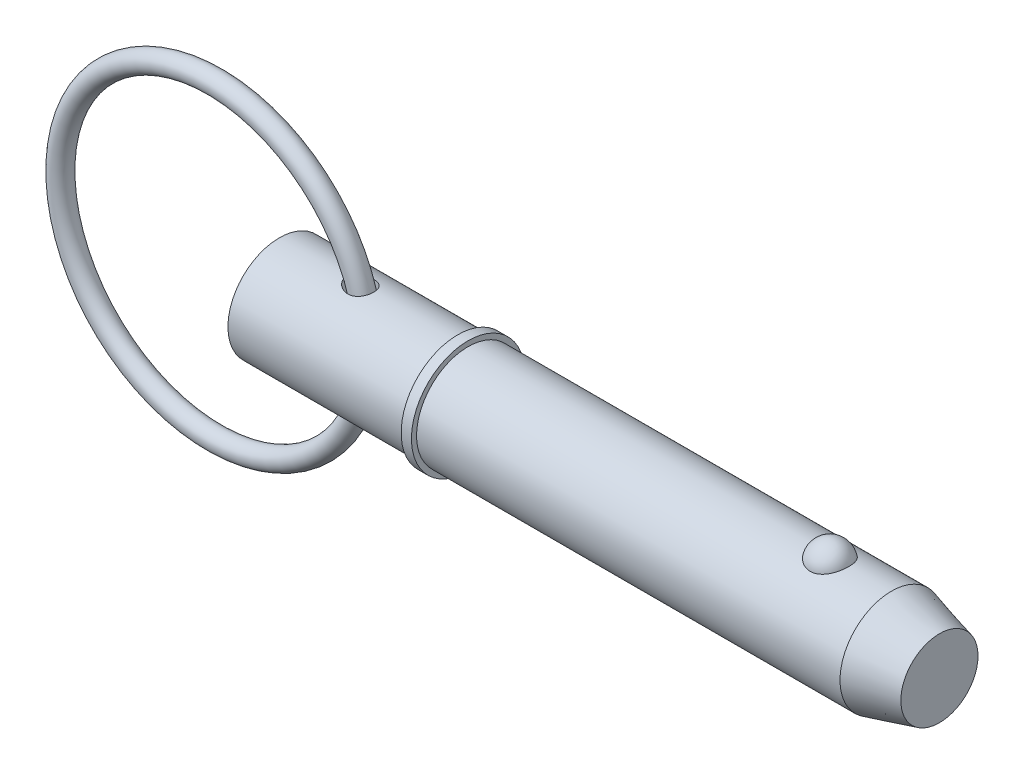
ISO-10303-21;
HEADER;
FILE_DESCRIPTION(('STEP AP214'),'2;1');
FILE_NAME('part.step','',(''),(''),'','','');
FILE_SCHEMA(('AUTOMOTIVE_DESIGN { 1 0 10303 214 1 1 1 1 }'));
ENDSEC;
DATA;
#1=APPLICATION_CONTEXT('core data for automotive mechanical design processes');
#2=APPLICATION_PROTOCOL_DEFINITION('international standard','automotive_design',2000,#1);
#3=PRODUCT_CONTEXT('',#1,'mechanical');
#4=PRODUCT('Part','Part','',(#3));
#5=PRODUCT_RELATED_PRODUCT_CATEGORY('part','',(#4));
#6=PRODUCT_DEFINITION_FORMATION('','',#4);
#7=PRODUCT_DEFINITION_CONTEXT('part definition',#1,'design');
#8=PRODUCT_DEFINITION('design','',#6,#7);
#9=PRODUCT_DEFINITION_SHAPE('','',#8);
#10=(LENGTH_UNIT() NAMED_UNIT(*) SI_UNIT(.MILLI.,.METRE.));
#11=(NAMED_UNIT(*) PLANE_ANGLE_UNIT() SI_UNIT($,.RADIAN.));
#12=(NAMED_UNIT(*) SI_UNIT($,.STERADIAN.) SOLID_ANGLE_UNIT());
#13=UNCERTAINTY_MEASURE_WITH_UNIT(LENGTH_MEASURE(1.E-05),#10,'distance_accuracy_value','');
#14=(GEOMETRIC_REPRESENTATION_CONTEXT(3) GLOBAL_UNCERTAINTY_ASSIGNED_CONTEXT((#13)) GLOBAL_UNIT_ASSIGNED_CONTEXT((#10,
#11,#12)) REPRESENTATION_CONTEXT('',''));
#15=CARTESIAN_POINT('',(0.,0.,0.));
#16=DIRECTION('',(0.,0.,1.));
#17=DIRECTION('',(1.,0.,0.));
#18=AXIS2_PLACEMENT_3D('',#15,#16,#17);
#19=CARTESIAN_POINT('',(-11.9894358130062,0.,0.));
#20=DIRECTION('',(0.,0.,1.));
#21=DIRECTION('',(1.,0.,0.));
#22=AXIS2_PLACEMENT_3D('',#19,#20,#21);
#23=TOROIDAL_SURFACE('',#22,28.575,1.905);
#24=CARTESIAN_POINT('',(18.4905641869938,0.,0.));
#25=VERTEX_POINT('',#24);
#26=VERTEX_LOOP('',#25);
#27=FACE_BOUND('',#26,.T.);
#28=ADVANCED_FACE('P0_F12',(#27),#23,.T.);
#29=CLOSED_SHELL('',(#28));
#30=MANIFOLD_SOLID_BREP('P0_B1',#29);
#31=CARTESIAN_POINT('',(0.,0.,0.));
#32=DIRECTION('',(1.,0.,0.));
#33=DIRECTION('',(0.,0.,-1.));
#34=AXIS2_PLACEMENT_3D('',#31,#32,#33);
#35=CYLINDRICAL_SURFACE('',#34,9.525);
#36=CARTESIAN_POINT('',(12.9513882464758,9.41921920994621,-1.41559473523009));
#37=CARTESIAN_POINT('',(13.0504692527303,9.40163924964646,-1.53256769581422));
#38=CARTESIAN_POINT('',(13.1602600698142,9.38319823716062,-1.6404459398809));
#39=CARTESIAN_POINT('',(13.3966485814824,9.34687220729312,-1.83618480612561));
#40=CARTESIAN_POINT('',(13.5232761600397,9.32898824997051,-1.92400906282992));
#41=CARTESIAN_POINT('',(13.78900694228,9.29593183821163,-2.07784697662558));
#42=CARTESIAN_POINT('',(13.9280753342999,9.28075215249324,-2.14391921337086));
#43=CARTESIAN_POINT('',(14.2153444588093,9.25488828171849,-2.25295850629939));
#44=CARTESIAN_POINT('',(14.3635415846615,9.24420233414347,-2.29593462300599));
#45=CARTESIAN_POINT('',(14.669669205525,9.22859713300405,-2.3579005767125));
#46=CARTESIAN_POINT('',(14.8277567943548,9.22385123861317,-2.37617053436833));
#47=CARTESIAN_POINT('',(15.1447573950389,9.22170813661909,-2.38448481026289));
#48=CARTESIAN_POINT('',(15.3036699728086,9.22430739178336,-2.3745427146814));
#49=CARTESIAN_POINT('',(15.6046561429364,9.2363636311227,-2.32717331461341));
#50=CARTESIAN_POINT('',(15.7470893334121,9.24528216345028,-2.29190131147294));
#51=CARTESIAN_POINT('',(16.0228763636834,9.26842607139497,-2.19642882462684));
#52=CARTESIAN_POINT('',(16.1562346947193,9.28264879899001,-2.1362407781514));
#53=CARTESIAN_POINT('',(16.3991522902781,9.31332263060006,-1.99805318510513));
#54=CARTESIAN_POINT('',(16.5097585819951,9.32951023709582,-1.92182839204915));
#55=CARTESIAN_POINT('',(16.7159974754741,9.36298467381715,-1.75147176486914));
#56=CARTESIAN_POINT('',(16.811631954,9.38027136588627,-1.65734217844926));
#57=CARTESIAN_POINT('',(16.9833240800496,9.41356881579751,-1.45618916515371));
#58=CARTESIAN_POINT('',(17.0597719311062,9.42959946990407,-1.34950141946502));
#59=CARTESIAN_POINT('',(17.1939538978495,9.45905380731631,-1.12462011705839));
#60=CARTESIAN_POINT('',(17.2516877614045,9.4724774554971,-1.00642640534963));
#61=CARTESIAN_POINT('',(17.3474400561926,9.49535683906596,-0.760990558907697));
#62=CARTESIAN_POINT('',(17.3853184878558,9.50478431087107,-0.633691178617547));
#63=CARTESIAN_POINT('',(17.4399027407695,9.51852575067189,-0.374363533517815));
#64=CARTESIAN_POINT('',(17.4566077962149,9.52283953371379,-0.242335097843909));
#65=CARTESIAN_POINT('',(17.4685150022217,9.52590431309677,0.0235692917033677));
#66=CARTESIAN_POINT('',(17.4635842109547,9.52462091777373,0.157451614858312));
#67=CARTESIAN_POINT('',(17.4320243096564,9.5165501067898,0.422467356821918));
#68=CARTESIAN_POINT('',(17.4053947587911,9.50976257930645,0.55360071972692));
#69=CARTESIAN_POINT('',(17.3310009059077,9.49140797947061,0.809490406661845));
#70=CARTESIAN_POINT('',(17.2832204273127,9.47983724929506,0.934241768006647));
#71=CARTESIAN_POINT('',(17.1676219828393,9.453180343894,1.1736825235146));
#72=CARTESIAN_POINT('',(17.0998044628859,9.43809424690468,1.28837214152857));
#73=CARTESIAN_POINT('',(16.9461013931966,9.40614962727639,1.50393386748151));
#74=CARTESIAN_POINT('',(16.8602910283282,9.38929862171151,1.6048606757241));
#75=CARTESIAN_POINT('',(16.6726759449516,9.35566510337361,1.79055313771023));
#76=CARTESIAN_POINT('',(16.5708731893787,9.33888258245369,1.87532077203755));
#77=CARTESIAN_POINT('',(16.3550631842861,9.30741331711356,2.02572386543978));
#78=CARTESIAN_POINT('',(16.2411701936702,9.29270956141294,2.09151983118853));
#79=CARTESIAN_POINT('',(16.0037488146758,9.26681293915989,2.20343355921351));
#80=CARTESIAN_POINT('',(15.8802207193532,9.25561996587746,2.24955191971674));
#81=CARTESIAN_POINT('',(15.6262451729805,9.23779438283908,2.32167613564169));
#82=CARTESIAN_POINT('',(15.4957570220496,9.23119272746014,2.34754561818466));
#83=CARTESIAN_POINT('',(15.2322153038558,9.22318493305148,2.37881082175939));
#84=CARTESIAN_POINT('',(15.0991611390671,9.22178001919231,2.38420171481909));
#85=CARTESIAN_POINT('',(14.8267609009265,9.22414647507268,2.37503099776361));
#86=CARTESIAN_POINT('',(14.6874545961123,9.22819578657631,2.35939810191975));
#87=CARTESIAN_POINT('',(14.412976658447,9.24129253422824,2.30756034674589));
#88=CARTESIAN_POINT('',(14.2778066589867,9.25034191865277,2.27134746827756));
#89=CARTESIAN_POINT('',(14.0027915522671,9.27334688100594,2.1756145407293));
#90=CARTESIAN_POINT('',(13.8635960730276,9.28766658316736,2.11431132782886));
#91=CARTESIAN_POINT('',(13.5969045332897,9.31925368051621,1.97041856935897));
#92=CARTESIAN_POINT('',(13.4694182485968,9.33652350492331,1.88781145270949));
#93=CARTESIAN_POINT('',(13.2243568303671,9.37286659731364,1.69844580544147));
#94=CARTESIAN_POINT('',(13.1075060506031,9.39198626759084,1.59075211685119));
#95=CARTESIAN_POINT('',(12.8957171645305,9.42881110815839,1.35544651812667));
#96=CARTESIAN_POINT('',(12.8007455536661,9.44651841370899,1.22786557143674));
#97=CARTESIAN_POINT('',(12.6580495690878,9.4741137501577,0.9887243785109));
#98=CARTESIAN_POINT('',(12.604453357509,9.4848570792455,0.880756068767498));
#99=CARTESIAN_POINT('',(12.515693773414,9.50295777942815,0.657225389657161));
#100=CARTESIAN_POINT('',(12.4805142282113,9.51031812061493,0.541669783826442));
#101=CARTESIAN_POINT('',(12.4305797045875,9.52083647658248,0.305475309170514));
#102=CARTESIAN_POINT('',(12.4159122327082,9.52397648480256,0.18481691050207));
#103=CARTESIAN_POINT('',(12.408320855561,9.52559626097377,-0.0572308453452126));
#104=CARTESIAN_POINT('',(12.4153963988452,9.52407614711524,-0.178620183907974));
#105=CARTESIAN_POINT('',(12.4495068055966,9.51684301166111,-0.409566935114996));
#106=CARTESIAN_POINT('',(12.4750931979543,9.51143444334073,-0.519353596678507));
#107=CARTESIAN_POINT('',(12.543120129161,9.49733710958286,-0.73328523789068));
#108=CARTESIAN_POINT('',(12.5855568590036,9.4886490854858,-0.837431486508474));
#109=CARTESIAN_POINT('',(12.6780792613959,9.47023833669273,-1.02356028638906));
#110=CARTESIAN_POINT('',(12.7261842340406,9.46084463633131,-1.10657511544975));
#111=CARTESIAN_POINT('',(12.8319313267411,9.44081892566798,-1.26610577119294));
#112=CARTESIAN_POINT('',(12.8895756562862,9.43018662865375,-1.34262008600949));
#113=CARTESIAN_POINT('',(12.9513882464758,9.41921920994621,-1.41559473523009));
#114=B_SPLINE_CURVE_WITH_KNOTS('',3,(#36,#37,#38,#39,#40,#41,#42,#43,#44,#45,#46,#47,#48,#49,
#50,#51,#52,#53,#54,#55,#56,#57,#58,#59,#60,#61,#62,#63,#64,#65,#66,#67,#68,#69,#70,#71,#72,#73,
#74,#75,#76,#77,#78,#79,#80,#81,#82,#83,#84,#85,#86,#87,#88,#89,#90,#91,#92,#93,#94,#95,#96,#97,
#98,#99,#100,#101,#102,#103,#104,#105,#106,#107,#108,#109,#110,#111,#112,#113),.UNSPECIFIED.,
.T.,.F.,(4,2,2,2,2,2,2,2,2,2,2,2,2,2,2,2,2,2,2,2,2,2,2,2,2,2,2,2,2,2,2,2,2,2,2,2,2,2,4),(0.,
0.462524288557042,0.925880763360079,1.3879789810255,1.8498957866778,2.3250010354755,
2.79987752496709,3.23851602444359,3.67693583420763,4.08084875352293,4.48471100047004,
4.87953549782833,5.27436531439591,5.67194282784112,6.0695347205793,6.46957303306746,
6.86961947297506,7.26997240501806,7.67031642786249,8.06901977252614,8.46767421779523,
8.86284969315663,9.25801315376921,9.65581560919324,10.0537118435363,10.4726706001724,
10.8917927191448,11.3481090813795,11.8048030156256,12.2824769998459,12.7594145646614,
13.1209614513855,13.4821903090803,13.8449555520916,14.2077115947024,14.5447865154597,
14.881785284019,15.170268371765,15.4588183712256),.UNSPECIFIED.);
#115=CARTESIAN_POINT('',(12.9513882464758,9.41921920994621,-1.41559473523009));
#116=VERTEX_POINT('',#115);
#117=EDGE_CURVE('P1_E42',#116,#116,#114,.T.);
#118=ORIENTED_EDGE('',*,*,#117,.T.);
#119=EDGE_LOOP('',(#118));
#120=FACE_BOUND('',#119,.T.);
#121=CARTESIAN_POINT('',(0.,0.,0.));
#122=DIRECTION('',(1.,0.,0.));
#123=DIRECTION('',(0.,0.,-1.));
#124=AXIS2_PLACEMENT_3D('',#121,#122,#123);
#125=CIRCLE('',#124,9.525);
#126=CARTESIAN_POINT('',(0.,0.,-9.525));
#127=VERTEX_POINT('',#126);
#128=EDGE_CURVE('P1_E9',#127,#127,#125,.T.);
#129=ORIENTED_EDGE('',*,*,#128,.T.);
#130=EDGE_LOOP('',(#129));
#131=FACE_BOUND('',#130,.T.);
#132=CARTESIAN_POINT('',(33.025,0.,0.));
#133=DIRECTION('',(1.,0.,0.));
#134=DIRECTION('',(0.,0.,-1.));
#135=AXIS2_PLACEMENT_3D('',#132,#133,#134);
#136=CIRCLE('',#135,9.525);
#137=CARTESIAN_POINT('',(33.025,0.,-9.525));
#138=VERTEX_POINT('',#137);
#139=EDGE_CURVE('P1_E25',#138,#138,#136,.T.);
#140=ORIENTED_EDGE('',*,*,#139,.F.);
#141=EDGE_LOOP('',(#140));
#142=FACE_BOUND('',#141,.T.);
#143=CARTESIAN_POINT('',(12.9513882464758,-9.41921920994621,-1.41559473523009));
#144=CARTESIAN_POINT('',(12.8706569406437,-9.43354320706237,-1.32028288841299));
#145=CARTESIAN_POINT('',(12.7970077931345,-9.44729974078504,-1.21890449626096));
#146=CARTESIAN_POINT('',(12.6667099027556,-9.47239055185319,-1.00546491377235));
#147=CARTESIAN_POINT('',(12.6100480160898,-9.48372669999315,-0.893412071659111));
#148=CARTESIAN_POINT('',(12.5163428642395,-9.50281544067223,-0.66020233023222));
#149=CARTESIAN_POINT('',(12.4794216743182,-9.51054569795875,-0.538993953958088));
#150=CARTESIAN_POINT('',(12.4282252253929,-9.52133525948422,-0.29167282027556));
#151=CARTESIAN_POINT('',(12.4139371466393,-9.52439720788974,-0.165562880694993));
#152=CARTESIAN_POINT('',(12.4092595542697,-9.52539668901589,0.0763263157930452));
#153=CARTESIAN_POINT('',(12.4169377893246,-9.5237485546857,0.192070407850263));
#154=CARTESIAN_POINT('',(12.4515961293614,-9.51640070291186,0.420478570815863));
#155=CARTESIAN_POINT('',(12.4785770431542,-9.51070081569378,0.533142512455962));
#156=CARTESIAN_POINT('',(12.5496371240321,-9.49599978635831,0.750537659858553));
#157=CARTESIAN_POINT('',(12.5934215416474,-9.48705569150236,0.855370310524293));
#158=CARTESIAN_POINT('',(12.6960201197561,-9.46670226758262,1.05710432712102));
#159=CARTESIAN_POINT('',(12.754838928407,-9.45529217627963,1.15400322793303));
#160=CARTESIAN_POINT('',(12.8926588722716,-9.42958102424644,1.34883014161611));
#161=CARTESIAN_POINT('',(12.9731843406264,-9.41509922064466,1.44565277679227));
#162=CARTESIAN_POINT('',(13.1473692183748,-9.38554264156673,1.62653953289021));
#163=CARTESIAN_POINT('',(13.2410364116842,-9.37046751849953,1.71059603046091));
#164=CARTESIAN_POINT('',(13.4543924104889,-9.33867330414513,1.87697964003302));
#165=CARTESIAN_POINT('',(13.5758667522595,-9.32205896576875,1.95704323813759));
#166=CARTESIAN_POINT('',(13.8299208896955,-9.29140277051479,2.09777392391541));
#167=CARTESIAN_POINT('',(13.9625074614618,-9.27736250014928,2.15842906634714));
#168=CARTESIAN_POINT('',(14.2477938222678,-9.25234849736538,2.26337318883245));
#169=CARTESIAN_POINT('',(14.4012368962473,-9.2417532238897,2.30575283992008));
#170=CARTESIAN_POINT('',(14.7134258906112,-9.22706044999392,2.36387471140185));
#171=CARTESIAN_POINT('',(14.8721705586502,-9.22296142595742,2.37962317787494));
#172=CARTESIAN_POINT('',(15.1841930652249,-9.22219798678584,2.38258156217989));
#173=CARTESIAN_POINT('',(15.3374581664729,-9.22526675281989,2.37081567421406));
#174=CARTESIAN_POINT('',(15.6390558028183,-9.23821642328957,2.31984408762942));
#175=CARTESIAN_POINT('',(15.7873916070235,-9.24809271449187,2.28065697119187));
#176=CARTESIAN_POINT('',(16.0605055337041,-9.27231045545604,2.17997072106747));
#177=CARTESIAN_POINT('',(16.1861988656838,-9.28616347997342,2.12082794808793));
#178=CARTESIAN_POINT('',(16.4248737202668,-9.31689725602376,1.9814435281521));
#179=CARTESIAN_POINT('',(16.5378583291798,-9.33377726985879,1.90120701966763));
#180=CARTESIAN_POINT('',(16.7424913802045,-9.36766057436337,1.72629138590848));
#181=CARTESIAN_POINT('',(16.8349077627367,-9.38461836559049,1.63249912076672));
#182=CARTESIAN_POINT('',(17.0025959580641,-9.41752009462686,1.43052052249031));
#183=CARTESIAN_POINT('',(17.0778684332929,-9.43346407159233,1.32233474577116));
#184=CARTESIAN_POINT('',(17.2093311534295,-9.46256896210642,1.09477833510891));
#185=CARTESIAN_POINT('',(17.2655443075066,-9.47573320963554,0.975421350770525));
#186=CARTESIAN_POINT('',(17.3577240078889,-9.49788660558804,0.728764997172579));
#187=CARTESIAN_POINT('',(17.3936897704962,-9.5068755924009,0.601465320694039));
#188=CARTESIAN_POINT('',(17.4447894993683,-9.51977728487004,0.341392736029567));
#189=CARTESIAN_POINT('',(17.4597470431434,-9.52364698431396,0.208583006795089));
#190=CARTESIAN_POINT('',(17.467935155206,-9.52575588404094,-0.0577507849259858));
#191=CARTESIAN_POINT('',(17.4611651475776,-9.52399493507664,-0.191274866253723));
#192=CARTESIAN_POINT('',(17.4259933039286,-9.51501704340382,-0.455658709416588));
#193=CARTESIAN_POINT('',(17.3975278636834,-9.50778405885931,-0.586509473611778));
#194=CARTESIAN_POINT('',(17.3195245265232,-9.48862442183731,-0.841413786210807));
#195=CARTESIAN_POINT('',(17.2699864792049,-9.47669773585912,-0.965467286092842));
#196=CARTESIAN_POINT('',(17.1510794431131,-9.44947793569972,-1.20302860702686));
#197=CARTESIAN_POINT('',(17.0817421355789,-9.43419020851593,-1.31655289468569));
#198=CARTESIAN_POINT('',(16.9249035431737,-9.40193593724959,-1.52999797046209));
#199=CARTESIAN_POINT('',(16.8374037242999,-9.38496952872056,-1.62991985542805));
#200=CARTESIAN_POINT('',(16.6472525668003,-9.35139745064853,-1.81261591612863));
#201=CARTESIAN_POINT('',(16.544718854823,-9.33479003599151,-1.89551219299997));
#202=CARTESIAN_POINT('',(16.3268885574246,-9.30366076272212,-2.04284430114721));
#203=CARTESIAN_POINT('',(16.2115933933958,-9.28913867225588,-2.10728218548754));
#204=CARTESIAN_POINT('',(15.9721327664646,-9.26380878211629,-2.21598517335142));
#205=CARTESIAN_POINT('',(15.8480095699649,-9.25298455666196,-2.26033977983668));
#206=CARTESIAN_POINT('',(15.5939970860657,-9.23601616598,-2.32870721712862));
#207=CARTESIAN_POINT('',(15.4641070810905,-9.22987258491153,-2.35271750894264));
#208=CARTESIAN_POINT('',(15.1982340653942,-9.22261892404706,-2.38099747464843));
#209=CARTESIAN_POINT('',(15.0621840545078,-9.22166165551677,-2.38466791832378));
#210=CARTESIAN_POINT('',(14.7911713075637,-9.22504733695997,-2.37153091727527));
#211=CARTESIAN_POINT('',(14.6562088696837,-9.2293916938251,-2.35471803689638));
#212=CARTESIAN_POINT('',(14.3799999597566,-9.24325361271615,-2.29972931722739));
#213=CARTESIAN_POINT('',(14.2390842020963,-9.25314817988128,-2.2599897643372));
#214=CARTESIAN_POINT('',(13.9651910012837,-9.27709186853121,-2.15959208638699));
#215=CARTESIAN_POINT('',(13.8322212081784,-9.29114491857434,-2.09891417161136));
#216=CARTESIAN_POINT('',(13.5621642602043,-9.32369066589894,-1.94960068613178));
#217=CARTESIAN_POINT('',(13.4264724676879,-9.34251276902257,-1.85849626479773));
#218=CARTESIAN_POINT('',(13.1736579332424,-9.38095091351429,-1.6535412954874));
#219=CARTESIAN_POINT('',(13.0565182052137,-9.40056620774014,-1.53971177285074));
#220=CARTESIAN_POINT('',(12.9513882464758,-9.41921920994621,-1.41559473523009));
#221=B_SPLINE_CURVE_WITH_KNOTS('',3,(#143,#144,#145,#146,#147,#148,#149,#150,#151,#152,#153,
#154,#155,#156,#157,#158,#159,#160,#161,#162,#163,#164,#165,#166,#167,#168,#169,#170,#171,#172,
#173,#174,#175,#176,#177,#178,#179,#180,#181,#182,#183,#184,#185,#186,#187,#188,#189,#190,#191,
#192,#193,#194,#195,#196,#197,#198,#199,#200,#201,#202,#203,#204,#205,#206,#207,#208,#209,#210,
#211,#212,#213,#214,#215,#216,#217,#218,#219,#220),.UNSPECIFIED.,.T.,.F.,(4,2,2,2,2,2,2,2,2,2,2,
2,2,2,2,2,2,2,2,2,2,2,2,2,2,2,2,2,2,2,2,2,2,2,2,2,2,2,4),(0.,0.376746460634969,0.75320065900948,
1.13195666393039,1.51049805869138,1.85679105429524,2.20309856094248,2.54359033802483,
2.88418751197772,3.26301611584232,3.64207005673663,4.07954912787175,4.51729693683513,
4.99355673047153,5.46970480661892,5.92841231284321,6.38680927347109,6.80346940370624,
7.22002812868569,7.61642768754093,8.01281192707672,8.40871801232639,8.80463942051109,
9.20386620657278,9.60310357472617,10.0035159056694,10.4039310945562,10.8037091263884,
11.2034549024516,11.6002252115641,11.9969513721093,12.3918916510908,12.7868812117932,
13.1934480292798,13.6001227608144,14.038511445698,14.4773156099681,14.9683748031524,
15.4589817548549),.UNSPECIFIED.);
#222=CARTESIAN_POINT('',(12.9513882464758,-9.41921920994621,-1.41559473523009));
#223=VERTEX_POINT('',#222);
#224=EDGE_CURVE('P1_E17',#223,#223,#221,.T.);
#225=ORIENTED_EDGE('',*,*,#224,.T.);
#226=EDGE_LOOP('',(#225));
#227=FACE_BOUND('',#226,.T.);
#228=ADVANCED_FACE('P1_F13',(#120,#131,#142,#227),#35,.T.);
#229=CARTESIAN_POINT('',(0.,0.,0.));
#230=DIRECTION('',(1.,0.,0.));
#231=DIRECTION('',(0.,0.,-1.));
#232=AXIS2_PLACEMENT_3D('',#229,#230,#231);
#233=CYLINDRICAL_SURFACE('',#232,9.525);
#234=CARTESIAN_POINT('',(113.343054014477,0.,0.));
#235=DIRECTION('',(1.,0.,0.));
#236=DIRECTION('',(0.,0.,-1.));
#237=AXIS2_PLACEMENT_3D('',#234,#235,#236);
#238=CIRCLE('',#237,9.525);
#239=CARTESIAN_POINT('',(113.343054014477,0.,-9.525));
#240=VERTEX_POINT('',#239);
#241=EDGE_CURVE('P1_E99',#240,#240,#238,.T.);
#242=ORIENTED_EDGE('',*,*,#241,.F.);
#243=EDGE_LOOP('',(#242));
#244=FACE_BOUND('',#243,.T.);
#245=CARTESIAN_POINT('',(34.93,0.,0.));
#246=DIRECTION('',(1.,0.,0.));
#247=DIRECTION('',(0.,0.,-1.));
#248=AXIS2_PLACEMENT_3D('',#245,#246,#247);
#249=CIRCLE('',#248,9.525);
#250=CARTESIAN_POINT('',(34.93,0.,-9.525));
#251=VERTEX_POINT('',#250);
#252=EDGE_CURVE('P1_E96',#251,#251,#249,.T.);
#253=ORIENTED_EDGE('',*,*,#252,.T.);
#254=EDGE_LOOP('',(#253));
#255=FACE_BOUND('',#254,.T.);
#256=CARTESIAN_POINT('',(101.945757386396,8.80405803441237,3.63513233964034));
#257=CARTESIAN_POINT('',(101.851676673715,8.80405953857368,3.63513053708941));
#258=CARTESIAN_POINT('',(101.757561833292,8.80561325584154,3.63137461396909));
#259=CARTESIAN_POINT('',(101.570012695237,8.81177748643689,3.61638665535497));
#260=CARTESIAN_POINT('',(101.476578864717,8.81638992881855,3.60514990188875));
#261=CARTESIAN_POINT('',(101.197945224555,8.83467114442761,3.56024627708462));
#262=CARTESIAN_POINT('',(101.014691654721,8.85278327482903,3.5153862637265));
#263=CARTESIAN_POINT('',(100.659509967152,8.89871214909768,3.39742145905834));
#264=CARTESIAN_POINT('',(100.487553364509,8.92650327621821,3.32439116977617));
#265=CARTESIAN_POINT('',(100.158707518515,8.98874819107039,3.15220244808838));
#266=CARTESIAN_POINT('',(100.001811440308,9.02319893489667,3.05305594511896));
#267=CARTESIAN_POINT('',(99.7022147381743,9.09629186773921,2.82797815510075));
#268=CARTESIAN_POINT('',(99.5600600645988,9.13502685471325,2.70135138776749));
#269=CARTESIAN_POINT('',(99.2982999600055,9.2118657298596,2.42641932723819));
#270=CARTESIAN_POINT('',(99.1787015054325,9.2499694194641,2.27810735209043));
#271=CARTESIAN_POINT('',(98.959645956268,9.32341082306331,1.95652290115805));
#272=CARTESIAN_POINT('',(98.8613174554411,9.35855090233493,1.78243511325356));
#273=CARTESIAN_POINT('',(98.6938190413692,9.42045142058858,1.41937246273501));
#274=CARTESIAN_POINT('',(98.6246511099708,9.44721128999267,1.23039658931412));
#275=CARTESIAN_POINT('',(98.5161994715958,9.48990641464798,0.84037088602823));
#276=CARTESIAN_POINT('',(98.4772880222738,9.50570658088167,0.639202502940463));
#277=CARTESIAN_POINT('',(98.4315550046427,9.52433146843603,0.23266436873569));
#278=CARTESIAN_POINT('',(98.4247324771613,9.52715657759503,0.0272947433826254));
#279=CARTESIAN_POINT('',(98.443255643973,9.51956918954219,-0.380478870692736));
#280=CARTESIAN_POINT('',(98.4684052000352,9.50923740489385,-0.582893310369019));
#281=CARTESIAN_POINT('',(98.5500253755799,9.47651897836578,-0.980293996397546));
#282=CARTESIAN_POINT('',(98.6064966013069,9.45413210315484,-1.17528009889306));
#283=CARTESIAN_POINT('',(98.7497192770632,9.39954044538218,-1.55263697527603));
#284=CARTESIAN_POINT('',(98.8365124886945,9.36732213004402,-1.73498993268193));
#285=CARTESIAN_POINT('',(99.0386103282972,9.29640700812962,-2.08177763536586));
#286=CARTESIAN_POINT('',(99.1539172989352,9.25770966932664,-2.24621090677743));
#287=CARTESIAN_POINT('',(99.411264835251,9.17775604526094,-2.5533833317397));
#288=CARTESIAN_POINT('',(99.5534344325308,9.136488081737,-2.696011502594));
#289=CARTESIAN_POINT('',(99.8608998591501,9.05620497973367,-2.95451229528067));
#290=CARTESIAN_POINT('',(100.026193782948,9.01718965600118,-3.070387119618));
#291=CARTESIAN_POINT('',(100.372052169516,8.94680019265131,-3.26976836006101));
#292=CARTESIAN_POINT('',(100.552227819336,8.91528408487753,-3.353897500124));
#293=CARTESIAN_POINT('',(100.925651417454,8.86272514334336,-3.49043503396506));
#294=CARTESIAN_POINT('',(101.118894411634,8.84167836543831,-3.54285537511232));
#295=CARTESIAN_POINT('',(101.502503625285,8.81348056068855,-3.61241306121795));
#296=CARTESIAN_POINT('',(101.692525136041,8.80568348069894,-3.63119339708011));
#297=CARTESIAN_POINT('',(102.073190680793,8.80289410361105,-3.63795342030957));
#298=CARTESIAN_POINT('',(102.263834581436,8.80789922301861,-3.62593932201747));
#299=CARTESIAN_POINT('',(102.634007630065,8.82974915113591,-3.57238430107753));
#300=CARTESIAN_POINT('',(102.813697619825,8.84621463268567,-3.53178890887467));
#301=CARTESIAN_POINT('',(103.163422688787,8.88875330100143,-3.42331083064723));
#302=CARTESIAN_POINT('',(103.333456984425,8.91482726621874,-3.35542593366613));
#303=CARTESIAN_POINT('',(103.663237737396,8.97448239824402,-3.19248225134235));
#304=CARTESIAN_POINT('',(103.822680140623,9.00821446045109,-3.0968647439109));
#305=CARTESIAN_POINT('',(104.123513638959,9.07935398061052,-2.88162736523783));
#306=CARTESIAN_POINT('',(104.264900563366,9.11676228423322,-2.76200196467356));
#307=CARTESIAN_POINT('',(104.53331931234,9.19347419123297,-2.49516285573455));
#308=CARTESIAN_POINT('',(104.659275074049,9.23277872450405,-2.34686614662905));
#309=CARTESIAN_POINT('',(104.885522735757,9.3073761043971,-2.0309368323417));
#310=CARTESIAN_POINT('',(104.98581004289,9.34266823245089,-1.86330077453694));
#311=CARTESIAN_POINT('',(105.161514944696,9.40674710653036,-1.50744893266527));
#312=CARTESIAN_POINT('',(105.236041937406,9.43529176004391,-1.31874876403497));
#313=CARTESIAN_POINT('',(105.35416505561,9.48144132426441,-0.930631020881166));
#314=CARTESIAN_POINT('',(105.397760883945,9.49904612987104,-0.73121334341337));
#315=CARTESIAN_POINT('',(105.453158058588,9.5215314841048,-0.327147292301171));
#316=CARTESIAN_POINT('',(105.464935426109,9.52640243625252,-0.12249509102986));
#317=CARTESIAN_POINT('',(105.456382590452,9.5228957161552,0.286018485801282));
#318=CARTESIAN_POINT('',(105.43605305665,9.5145183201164,0.489879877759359));
#319=CARTESIAN_POINT('',(105.363884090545,9.48544083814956,0.889994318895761));
#320=CARTESIAN_POINT('',(105.312199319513,9.46480124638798,1.08627971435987));
#321=CARTESIAN_POINT('',(105.178491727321,9.41333895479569,1.46682086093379));
#322=CARTESIAN_POINT('',(105.096466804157,9.38251554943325,1.65107577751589));
#323=CARTESIAN_POINT('',(104.90319292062,9.31365636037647,2.00346348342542));
#324=CARTESIAN_POINT('',(104.791783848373,9.27558138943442,2.17150083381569));
#325=CARTESIAN_POINT('',(104.542294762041,9.19638714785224,2.48563115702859));
#326=CARTESIAN_POINT('',(104.404216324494,9.15526805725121,2.63172542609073));
#327=CARTESIAN_POINT('',(104.104843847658,9.07465393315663,2.89750997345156));
#328=CARTESIAN_POINT('',(103.943610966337,9.03515496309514,3.01726776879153));
#329=CARTESIAN_POINT('',(103.601613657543,8.96227564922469,3.22732920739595));
#330=CARTESIAN_POINT('',(103.420841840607,8.92889763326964,3.31762165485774));
#331=CARTESIAN_POINT('',(103.051445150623,8.8734538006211,3.46314419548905));
#332=CARTESIAN_POINT('',(102.86332371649,8.85102983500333,3.51950082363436));
#333=CARTESIAN_POINT('',(102.57578699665,8.8266696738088,3.57993683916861));
#334=CARTESIAN_POINT('',(102.479133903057,8.82009725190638,3.5960621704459));
#335=CARTESIAN_POINT('',(102.284677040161,8.81020897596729,3.62022512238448));
#336=CARTESIAN_POINT('',(102.18687410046,8.80689090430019,3.62826825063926));
#337=CARTESIAN_POINT('',(102.041224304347,8.80445615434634,3.63416760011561));
#338=CARTESIAN_POINT('',(101.993495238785,8.80405727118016,3.63513325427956));
#339=CARTESIAN_POINT('',(101.945757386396,8.80405803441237,3.63513233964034));
#340=B_SPLINE_CURVE_WITH_KNOTS('',3,(#256,#257,#258,#259,#260,#261,#262,#263,#264,#265,#266,
#267,#268,#269,#270,#271,#272,#273,#274,#275,#276,#277,#278,#279,#280,#281,#282,#283,#284,#285,
#286,#287,#288,#289,#290,#291,#292,#293,#294,#295,#296,#297,#298,#299,#300,#301,#302,#303,#304,
#305,#306,#307,#308,#309,#310,#311,#312,#313,#314,#315,#316,#317,#318,#319,#320,#321,#322,#323,
#324,#325,#326,#327,#328,#329,#330,#331,#332,#333,#334,#335,#336,#337,#338,#339),.UNSPECIFIED.,
.T.,.F.,(4,2,2,2,2,2,2,2,2,2,2,2,2,2,2,2,2,2,2,2,2,2,2,2,2,2,2,2,2,2,2,2,2,2,2,2,2,2,2,2,2,4),
(0.,0.282202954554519,0.564584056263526,1.13017050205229,1.69427128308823,2.25811483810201,
2.83836627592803,3.4187968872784,4.02497117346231,4.63118665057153,5.24474754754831,
5.85829010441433,6.46808687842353,7.07789545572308,7.68854723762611,8.29924920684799,
8.9129628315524,9.52662591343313,10.1275338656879,10.7282152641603,11.2986646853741,
11.8689989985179,12.4213015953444,12.973648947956,13.5380053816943,14.1024919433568,
14.695298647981,15.2882113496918,15.8999469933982,16.5116885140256,17.1238909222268,
17.7360805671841,18.3452748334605,18.9545113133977,19.567138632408,20.179729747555,
20.7907316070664,21.4019653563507,21.9915938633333,22.2859053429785,22.5800161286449,
22.7232098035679),.UNSPECIFIED.);
#341=CARTESIAN_POINT('',(101.945757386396,8.80405803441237,3.63513233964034));
#342=VERTEX_POINT('',#341);
#343=EDGE_CURVE('P1_E34',#342,#342,#340,.T.);
#344=ORIENTED_EDGE('',*,*,#343,.T.);
#345=EDGE_LOOP('',(#344));
#346=FACE_BOUND('',#345,.T.);
#347=ADVANCED_FACE('P1_F46',(#244,#255,#346),#233,.T.);
#348=CARTESIAN_POINT('',(0.,0.,0.));
#349=DIRECTION('',(-1.,0.,0.));
#350=DIRECTION('',(0.,0.,1.));
#351=AXIS2_PLACEMENT_3D('',#348,#349,#350);
#352=PLANE('',#351);
#353=ORIENTED_EDGE('',*,*,#128,.F.);
#354=EDGE_LOOP('',(#353));
#355=FACE_BOUND('',#354,.T.);
#356=ADVANCED_FACE('P1_F15',(#355),#352,.T.);
#357=CARTESIAN_POINT('',(33.025,9.525,0.));
#358=DIRECTION('',(-1.,0.,0.));
#359=DIRECTION('',(0.,0.,1.));
#360=AXIS2_PLACEMENT_3D('',#357,#358,#359);
#361=PLANE('',#360);
#362=ORIENTED_EDGE('',*,*,#139,.T.);
#363=EDGE_LOOP('',(#362));
#364=FACE_BOUND('',#363,.T.);
#365=CARTESIAN_POINT('',(33.025,0.,0.));
#366=DIRECTION('',(1.,0.,0.));
#367=DIRECTION('',(0.,0.,-1.));
#368=AXIS2_PLACEMENT_3D('',#365,#366,#367);
#369=CIRCLE('',#368,10.4775);
#370=CARTESIAN_POINT('',(33.025,0.,-10.4775));
#371=VERTEX_POINT('',#370);
#372=EDGE_CURVE('P1_E30',#371,#371,#369,.T.);
#373=ORIENTED_EDGE('',*,*,#372,.F.);
#374=EDGE_LOOP('',(#373));
#375=FACE_BOUND('',#374,.T.);
#376=ADVANCED_FACE('P1_F81',(#364,#375),#361,.T.);
#377=CARTESIAN_POINT('',(0.,0.,0.));
#378=DIRECTION('',(1.,0.,0.));
#379=DIRECTION('',(0.,0.,-1.));
#380=AXIS2_PLACEMENT_3D('',#377,#378,#379);
#381=CYLINDRICAL_SURFACE('',#380,10.4775);
#382=ORIENTED_EDGE('',*,*,#372,.T.);
#383=EDGE_LOOP('',(#382));
#384=FACE_BOUND('',#383,.T.);
#385=CARTESIAN_POINT('',(34.93,0.,0.));
#386=DIRECTION('',(1.,0.,0.));
#387=DIRECTION('',(0.,0.,-1.));
#388=AXIS2_PLACEMENT_3D('',#385,#386,#387);
#389=CIRCLE('',#388,10.4775);
#390=CARTESIAN_POINT('',(34.93,0.,-10.4775));
#391=VERTEX_POINT('',#390);
#392=EDGE_CURVE('P1_E95',#391,#391,#389,.T.);
#393=ORIENTED_EDGE('',*,*,#392,.F.);
#394=EDGE_LOOP('',(#393));
#395=FACE_BOUND('',#394,.T.);
#396=ADVANCED_FACE('P1_F68',(#384,#395),#381,.T.);
#397=CARTESIAN_POINT('',(34.93,10.4775,0.));
#398=DIRECTION('',(1.,0.,0.));
#399=DIRECTION('',(0.,0.,-1.));
#400=AXIS2_PLACEMENT_3D('',#397,#398,#399);
#401=PLANE('',#400);
#402=ORIENTED_EDGE('',*,*,#392,.T.);
#403=EDGE_LOOP('',(#402));
#404=FACE_BOUND('',#403,.T.);
#405=ORIENTED_EDGE('',*,*,#252,.F.);
#406=EDGE_LOOP('',(#405));
#407=FACE_BOUND('',#406,.T.);
#408=ADVANCED_FACE('P1_F62',(#404,#407),#401,.T.);
#409=CARTESIAN_POINT('',(122.23,0.,0.));
#410=DIRECTION('',(-1.,0.,0.));
#411=DIRECTION('',(0.,0.,1.));
#412=AXIS2_PLACEMENT_3D('',#409,#410,#411);
#413=CONICAL_SURFACE('',#412,7.14375000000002,0.261799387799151);
#414=ORIENTED_EDGE('',*,*,#241,.T.);
#415=EDGE_LOOP('',(#414));
#416=FACE_BOUND('',#415,.T.);
#417=CARTESIAN_POINT('',(122.23,0.,0.));
#418=DIRECTION('',(1.,0.,0.));
#419=DIRECTION('',(0.,0.,-1.));
#420=AXIS2_PLACEMENT_3D('',#417,#418,#419);
#421=CIRCLE('',#420,7.14375000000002);
#422=CARTESIAN_POINT('',(122.23,0.,-7.14375000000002));
#423=VERTEX_POINT('',#422);
#424=EDGE_CURVE('P1_E41',#423,#423,#421,.T.);
#425=ORIENTED_EDGE('',*,*,#424,.F.);
#426=EDGE_LOOP('',(#425));
#427=FACE_BOUND('',#426,.T.);
#428=ADVANCED_FACE('P1_F59',(#416,#427),#413,.T.);
#429=CARTESIAN_POINT('',(122.23,7.14375000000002,0.));
#430=DIRECTION('',(1.,0.,0.));
#431=DIRECTION('',(0.,0.,-1.));
#432=AXIS2_PLACEMENT_3D('',#429,#430,#431);
#433=PLANE('',#432);
#434=ORIENTED_EDGE('',*,*,#424,.T.);
#435=EDGE_LOOP('',(#434));
#436=FACE_BOUND('',#435,.T.);
#437=ADVANCED_FACE('P1_F55',(#436),#433,.T.);
#438=CARTESIAN_POINT('',(101.945757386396,8.5725,0.));
#439=DIRECTION('',(-1.,0.,0.));
#440=DIRECTION('',(0.,-1.,0.));
#441=AXIS2_PLACEMENT_3D('',#438,#439,#440);
#442=SPHERICAL_SURFACE('',#441,3.64249999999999);
#443=ORIENTED_EDGE('',*,*,#343,.F.);
#444=EDGE_LOOP('',(#443));
#445=FACE_BOUND('',#444,.T.);
#446=ADVANCED_FACE('P1_F50',(#445),#442,.T.);
#447=CARTESIAN_POINT('',(-11.9894358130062,0.,0.));
#448=DIRECTION('',(0.,0.,1.));
#449=DIRECTION('',(1.,0.,0.));
#450=AXIS2_PLACEMENT_3D('',#447,#448,#449);
#451=TOROIDAL_SURFACE('',#450,28.575,2.38125);
#452=ORIENTED_EDGE('',*,*,#224,.F.);
#453=EDGE_LOOP('',(#452));
#454=FACE_BOUND('',#453,.T.);
#455=ORIENTED_EDGE('',*,*,#117,.F.);
#456=EDGE_LOOP('',(#455));
#457=FACE_BOUND('',#456,.T.);
#458=ADVANCED_FACE('P1_F54',(#454,#457),#451,.F.);
#459=CLOSED_SHELL('',(#228,#347,#356,#376,#396,#408,#428,#437,#446,#458));
#460=MANIFOLD_SOLID_BREP('P1_B1',#459);
#461=ADVANCED_BREP_SHAPE_REPRESENTATION('',(#18,#30,#460),#14);
#462=SHAPE_DEFINITION_REPRESENTATION(#9,#461);
ENDSEC;
END-ISO-10303-21;
